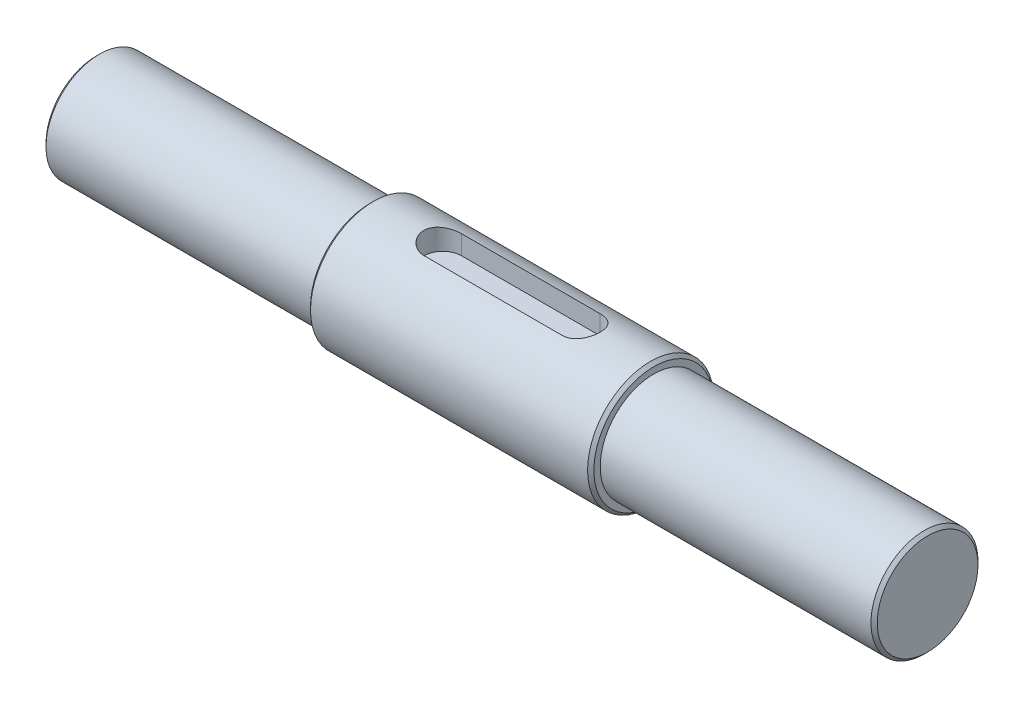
ISO-10303-21;
HEADER;
FILE_DESCRIPTION(('STEP AP214'),'2;1');
FILE_NAME('part.step','',(''),(''),'','','');
FILE_SCHEMA(('AUTOMOTIVE_DESIGN { 1 0 10303 214 1 1 1 1 }'));
ENDSEC;
DATA;
#1=APPLICATION_CONTEXT('core data for automotive mechanical design processes');
#2=APPLICATION_PROTOCOL_DEFINITION('international standard','automotive_design',2000,#1);
#3=PRODUCT_CONTEXT('',#1,'mechanical');
#4=PRODUCT('Part','Part','',(#3));
#5=PRODUCT_RELATED_PRODUCT_CATEGORY('part','',(#4));
#6=PRODUCT_DEFINITION_FORMATION('','',#4);
#7=PRODUCT_DEFINITION_CONTEXT('part definition',#1,'design');
#8=PRODUCT_DEFINITION('design','',#6,#7);
#9=PRODUCT_DEFINITION_SHAPE('','',#8);
#10=(LENGTH_UNIT() NAMED_UNIT(*) SI_UNIT(.MILLI.,.METRE.));
#11=(NAMED_UNIT(*) PLANE_ANGLE_UNIT() SI_UNIT($,.RADIAN.));
#12=(NAMED_UNIT(*) SI_UNIT($,.STERADIAN.) SOLID_ANGLE_UNIT());
#13=UNCERTAINTY_MEASURE_WITH_UNIT(LENGTH_MEASURE(1.E-05),#10,'distance_accuracy_value','');
#14=(GEOMETRIC_REPRESENTATION_CONTEXT(3) GLOBAL_UNCERTAINTY_ASSIGNED_CONTEXT((#13)) GLOBAL_UNIT_ASSIGNED_CONTEXT((#10,
#11,#12)) REPRESENTATION_CONTEXT('',''));
#15=CARTESIAN_POINT('',(0.,0.,0.));
#16=DIRECTION('',(0.,0.,1.));
#17=DIRECTION('',(1.,0.,0.));
#18=AXIS2_PLACEMENT_3D('',#15,#16,#17);
#19=CARTESIAN_POINT('',(88.5,0.,0.));
#20=DIRECTION('',(-1.,0.,0.));
#21=DIRECTION('',(0.,0.,1.));
#22=AXIS2_PLACEMENT_3D('',#19,#20,#21);
#23=CYLINDRICAL_SURFACE('',#22,10.);
#24=CARTESIAN_POINT('',(77.,9.53939201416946,3.));
#25=CARTESIAN_POINT('',(77.0823355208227,9.53938054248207,3.00001027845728));
#26=CARTESIAN_POINT('',(77.1646644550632,9.54045772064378,2.99661062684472));
#27=CARTESIAN_POINT('',(77.3286939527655,9.54470412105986,2.98307142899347));
#28=CARTESIAN_POINT('',(77.4103946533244,9.54787287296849,2.97293339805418));
#29=CARTESIAN_POINT('',(77.5723849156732,9.55620668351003,2.94603140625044));
#30=CARTESIAN_POINT('',(77.652677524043,9.56136667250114,2.92928426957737));
#31=CARTESIAN_POINT('',(77.8114758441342,9.57351626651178,2.88932853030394));
#32=CARTESIAN_POINT('',(77.8899815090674,9.58050591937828,2.8661197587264));
#33=CARTESIAN_POINT('',(78.1219493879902,9.60391637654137,2.78708584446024));
#34=CARTESIAN_POINT('',(78.272068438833,9.62279007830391,2.72181852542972));
#35=CARTESIAN_POINT('',(78.559226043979,9.66493213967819,2.56815043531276));
#36=CARTESIAN_POINT('',(78.6962584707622,9.68820254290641,2.4797388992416));
#37=CARTESIAN_POINT('',(78.9577229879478,9.73733650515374,2.27929879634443));
#38=CARTESIAN_POINT('',(79.0816848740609,9.76325505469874,2.16666914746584));
#39=CARTESIAN_POINT('',(79.3092736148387,9.81429628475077,1.92227736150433));
#40=CARTESIAN_POINT('',(79.412897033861,9.8394188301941,1.79051199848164));
#41=CARTESIAN_POINT('',(79.5989268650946,9.88666477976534,1.50821997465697));
#42=CARTESIAN_POINT('',(79.6808501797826,9.90871541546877,1.35736167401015));
#43=CARTESIAN_POINT('',(79.8179770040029,9.94668940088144,1.04324233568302));
#44=CARTESIAN_POINT('',(79.873187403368,9.96261433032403,0.879984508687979));
#45=CARTESIAN_POINT('',(79.953759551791,9.98615279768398,0.550649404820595));
#46=CARTESIAN_POINT('',(79.9799297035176,9.99399098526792,0.384786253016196));
#47=CARTESIAN_POINT('',(80.004234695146,10.0012640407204,0.0508471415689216));
#48=CARTESIAN_POINT('',(80.0023748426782,10.0007004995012,-0.117228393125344));
#49=CARTESIAN_POINT('',(79.9712141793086,9.99139205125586,-0.445143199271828));
#50=CARTESIAN_POINT('',(79.9427893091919,9.98290831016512,-0.605074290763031));
#51=CARTESIAN_POINT('',(79.8607367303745,9.95903027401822,-0.917780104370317));
#52=CARTESIAN_POINT('',(79.8071077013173,9.94363561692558,-1.07055445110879));
#53=CARTESIAN_POINT('',(79.6755755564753,9.90730429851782,-1.36669563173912));
#54=CARTESIAN_POINT('',(79.5973967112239,9.88630511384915,-1.50993201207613));
#55=CARTESIAN_POINT('',(79.4192028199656,9.84099249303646,-1.78153105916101));
#56=CARTESIAN_POINT('',(79.3191828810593,9.81667831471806,-1.90989038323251));
#57=CARTESIAN_POINT('',(79.0956160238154,9.7662334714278,-2.15330901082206));
#58=CARTESIAN_POINT('',(78.9713122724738,9.74006890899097,-2.26766702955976));
#59=CARTESIAN_POINT('',(78.7050051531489,9.68968430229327,-2.47413538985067));
#60=CARTESIAN_POINT('',(78.5629966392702,9.66546482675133,-2.5662392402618));
#61=CARTESIAN_POINT('',(78.2634381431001,9.62154457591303,-2.72632814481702));
#62=CARTESIAN_POINT('',(78.1057456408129,9.60189192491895,-2.79406012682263));
#63=CARTESIAN_POINT('',(77.7805509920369,9.56991327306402,-2.90171772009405));
#64=CARTESIAN_POINT('',(77.6130642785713,9.55757606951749,-2.94168586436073));
#65=CARTESIAN_POINT('',(77.3700102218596,9.54628064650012,-2.97802407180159));
#66=CARTESIAN_POINT('',(77.2962185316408,9.54370312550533,-2.98626405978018));
#67=CARTESIAN_POINT('',(77.148297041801,9.54025857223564,-2.99724711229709));
#68=CARTESIAN_POINT('',(77.0741679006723,9.53938902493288,-2.99999825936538));
#69=CARTESIAN_POINT('',(77.,9.53939201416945,-3.));
#70=B_SPLINE_CURVE_WITH_KNOTS('',3,(#24,#25,#26,#27,#28,#29,#30,#31,#32,#33,#34,#35,#36,#37,#38,
#39,#40,#41,#42,#43,#44,#45,#46,#47,#48,#49,#50,#51,#52,#53,#54,#55,#56,#57,#58,#59,#60,#61,#62,
#63,#64,#65,#66,#67,#68,#69),.UNSPECIFIED.,.F.,.F.,(4,2,2,2,2,2,2,2,2,2,2,2,2,2,2,2,2,2,2,2,2,2,
4),(0.,0.246918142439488,0.493780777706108,0.740019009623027,0.986263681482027,1.47813347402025,
1.97023245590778,2.47635119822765,2.98255536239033,3.4992281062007,4.01576751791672,
4.51753600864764,5.01920948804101,5.50490358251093,5.99062312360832,6.48200583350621,
6.9734987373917,7.48389234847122,7.99443465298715,8.51013494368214,9.02504345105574,
9.24774267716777,9.47011372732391),.UNSPECIFIED.);
#71=CARTESIAN_POINT('',(77.,9.53939201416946,3.));
#72=VERTEX_POINT('',#71);
#73=CARTESIAN_POINT('',(77.,9.53939201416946,-3.));
#74=VERTEX_POINT('',#73);
#75=EDGE_CURVE('E11',#72,#74,#70,.T.);
#76=ORIENTED_EDGE('',*,*,#75,.F.);
#77=DIRECTION('',(-1.,0.,0.));
#78=VECTOR('',#77,1.);
#79=CARTESIAN_POINT('',(88.5,9.53939201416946,3.));
#80=LINE('',#79,#78);
#81=CARTESIAN_POINT('',(55.,9.53939201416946,3.));
#82=VERTEX_POINT('',#81);
#83=EDGE_CURVE('E90',#82,#72,#80,.F.);
#84=ORIENTED_EDGE('',*,*,#83,.F.);
#85=CARTESIAN_POINT('',(55.,9.53939201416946,-3.));
#86=CARTESIAN_POINT('',(54.9176644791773,9.53938054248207,-3.00001027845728));
#87=CARTESIAN_POINT('',(54.8353355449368,9.54045772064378,-2.99661062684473));
#88=CARTESIAN_POINT('',(54.6713060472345,9.54470412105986,-2.98307142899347));
#89=CARTESIAN_POINT('',(54.5896053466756,9.54787287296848,-2.97293339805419));
#90=CARTESIAN_POINT('',(54.4276150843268,9.55620668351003,-2.94603140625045));
#91=CARTESIAN_POINT('',(54.347322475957,9.56136667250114,-2.92928426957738));
#92=CARTESIAN_POINT('',(54.1885241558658,9.57351626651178,-2.88932853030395));
#93=CARTESIAN_POINT('',(54.1100184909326,9.58050591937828,-2.86611975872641));
#94=CARTESIAN_POINT('',(53.8780506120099,9.60391637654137,-2.78708584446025));
#95=CARTESIAN_POINT('',(53.727931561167,9.62279007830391,-2.72181852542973));
#96=CARTESIAN_POINT('',(53.440773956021,9.66493213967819,-2.56815043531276));
#97=CARTESIAN_POINT('',(53.3037415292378,9.68820254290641,-2.4797388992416));
#98=CARTESIAN_POINT('',(53.0422770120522,9.73733650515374,-2.27929879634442));
#99=CARTESIAN_POINT('',(52.9183151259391,9.76325505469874,-2.16666914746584));
#100=CARTESIAN_POINT('',(52.6907263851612,9.81429628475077,-1.92227736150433));
#101=CARTESIAN_POINT('',(52.587102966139,9.8394188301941,-1.79051199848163));
#102=CARTESIAN_POINT('',(52.4010731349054,9.88666477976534,-1.50821997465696));
#103=CARTESIAN_POINT('',(52.3191498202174,9.90871541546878,-1.35736167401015));
#104=CARTESIAN_POINT('',(52.1820229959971,9.94668940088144,-1.04324233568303));
#105=CARTESIAN_POINT('',(52.126812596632,9.96261433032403,-0.879984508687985));
#106=CARTESIAN_POINT('',(52.046240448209,9.98615279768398,-0.550649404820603));
#107=CARTESIAN_POINT('',(52.0200702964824,9.99399098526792,-0.384786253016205));
#108=CARTESIAN_POINT('',(51.995765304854,10.0012640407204,-0.0508471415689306));
#109=CARTESIAN_POINT('',(51.9976251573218,10.0007004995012,0.117228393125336));
#110=CARTESIAN_POINT('',(52.0287858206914,9.99139205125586,0.445143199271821));
#111=CARTESIAN_POINT('',(52.0572106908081,9.98290831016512,0.605074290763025));
#112=CARTESIAN_POINT('',(52.1392632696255,9.95903027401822,0.917780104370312));
#113=CARTESIAN_POINT('',(52.1928922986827,9.94363561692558,1.07055445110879));
#114=CARTESIAN_POINT('',(52.3244244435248,9.90730429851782,1.36669563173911));
#115=CARTESIAN_POINT('',(52.4026032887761,9.88630511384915,1.50993201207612));
#116=CARTESIAN_POINT('',(52.5807971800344,9.84099249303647,1.781531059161));
#117=CARTESIAN_POINT('',(52.6808171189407,9.81667831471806,1.9098903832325));
#118=CARTESIAN_POINT('',(52.9043839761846,9.7662334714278,2.15330901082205));
#119=CARTESIAN_POINT('',(53.0286877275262,9.74006890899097,2.26766702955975));
#120=CARTESIAN_POINT('',(53.2949948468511,9.68968430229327,2.47413538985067));
#121=CARTESIAN_POINT('',(53.4370033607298,9.66546482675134,2.5662392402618));
#122=CARTESIAN_POINT('',(53.7365618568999,9.62154457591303,2.72632814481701));
#123=CARTESIAN_POINT('',(53.8942543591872,9.60189192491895,2.79406012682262));
#124=CARTESIAN_POINT('',(54.2194490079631,9.56991327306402,2.90171772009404));
#125=CARTESIAN_POINT('',(54.3869357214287,9.55757606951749,2.94168586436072));
#126=CARTESIAN_POINT('',(54.6299897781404,9.54628064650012,2.97802407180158));
#127=CARTESIAN_POINT('',(54.7037814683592,9.54370312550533,2.98626405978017));
#128=CARTESIAN_POINT('',(54.851702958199,9.54025857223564,2.99724711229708));
#129=CARTESIAN_POINT('',(54.9258320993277,9.53938902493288,2.99999825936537));
#130=CARTESIAN_POINT('',(55.,9.53939201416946,3.));
#131=B_SPLINE_CURVE_WITH_KNOTS('',3,(#85,#86,#87,#88,#89,#90,#91,#92,#93,#94,#95,#96,#97,#98,
#99,#100,#101,#102,#103,#104,#105,#106,#107,#108,#109,#110,#111,#112,#113,#114,#115,#116,#117,
#118,#119,#120,#121,#122,#123,#124,#125,#126,#127,#128,#129,#130),.UNSPECIFIED.,.F.,.F.,(4,2,2,
2,2,2,2,2,2,2,2,2,2,2,2,2,2,2,2,2,2,2,4),(0.,0.246918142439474,0.493780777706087,
0.740019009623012,0.986263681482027,1.47813347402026,1.97023245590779,2.47635119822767,
2.98255536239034,3.49922810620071,4.01576751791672,4.51753600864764,5.01920948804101,
5.50490358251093,5.99062312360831,6.48200583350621,6.9734987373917,7.48389234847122,
7.99443465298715,8.51013494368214,9.02504345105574,9.24774267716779,9.47011372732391),.UNSPECIFIED.);
#132=CARTESIAN_POINT('',(55.,9.53939201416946,-3.));
#133=VERTEX_POINT('',#132);
#134=EDGE_CURVE('E164',#133,#82,#131,.T.);
#135=ORIENTED_EDGE('',*,*,#134,.F.);
#136=DIRECTION('',(-1.,0.,0.));
#137=VECTOR('',#136,1.);
#138=CARTESIAN_POINT('',(88.5,9.53939201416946,-3.));
#139=LINE('',#138,#137);
#140=EDGE_CURVE('E56',#74,#133,#139,.T.);
#141=ORIENTED_EDGE('',*,*,#140,.F.);
#142=EDGE_LOOP('',(#76,#84,#135,#141));
#143=FACE_BOUND('',#142,.T.);
#144=CARTESIAN_POINT('',(88.,0.,0.));
#145=DIRECTION('',(1.,0.,0.));
#146=DIRECTION('',(0.,0.,-1.));
#147=AXIS2_PLACEMENT_3D('',#144,#145,#146);
#148=CIRCLE('',#147,10.);
#149=CARTESIAN_POINT('',(88.,0.,-10.));
#150=VERTEX_POINT('',#149);
#151=EDGE_CURVE('E134',#150,#150,#148,.F.);
#152=ORIENTED_EDGE('',*,*,#151,.T.);
#153=EDGE_LOOP('',(#152));
#154=FACE_BOUND('',#153,.T.);
#155=CARTESIAN_POINT('',(44.,0.,0.));
#156=DIRECTION('',(-1.,0.,0.));
#157=DIRECTION('',(0.,0.,1.));
#158=AXIS2_PLACEMENT_3D('',#155,#156,#157);
#159=CIRCLE('',#158,10.);
#160=CARTESIAN_POINT('',(44.,0.,10.));
#161=VERTEX_POINT('',#160);
#162=EDGE_CURVE('E127',#161,#161,#159,.F.);
#163=ORIENTED_EDGE('',*,*,#162,.T.);
#164=EDGE_LOOP('',(#163));
#165=FACE_BOUND('',#164,.T.);
#166=ADVANCED_FACE('F41',(#143,#154,#165),#23,.T.);
#167=CARTESIAN_POINT('',(88.5,10.,0.));
#168=DIRECTION('',(1.,0.,0.));
#169=DIRECTION('',(0.,0.,-1.));
#170=AXIS2_PLACEMENT_3D('',#167,#168,#169);
#171=PLANE('',#170);
#172=CARTESIAN_POINT('',(88.5,0.,0.));
#173=DIRECTION('',(1.,0.,0.));
#174=DIRECTION('',(0.,0.,-1.));
#175=AXIS2_PLACEMENT_3D('',#172,#173,#174);
#176=CIRCLE('',#175,9.49999999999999);
#177=CARTESIAN_POINT('',(88.5,0.,-9.49999999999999));
#178=VERTEX_POINT('',#177);
#179=EDGE_CURVE('E138',#178,#178,#176,.T.);
#180=ORIENTED_EDGE('',*,*,#179,.T.);
#181=EDGE_LOOP('',(#180));
#182=FACE_BOUND('',#181,.T.);
#183=CARTESIAN_POINT('',(88.5,0.,0.));
#184=DIRECTION('',(1.,0.,0.));
#185=DIRECTION('',(0.,0.,-1.));
#186=AXIS2_PLACEMENT_3D('',#183,#184,#185);
#187=CIRCLE('',#186,8.5);
#188=CARTESIAN_POINT('',(88.5,0.,-8.5));
#189=VERTEX_POINT('',#188);
#190=EDGE_CURVE('E123',#189,#189,#187,.T.);
#191=ORIENTED_EDGE('',*,*,#190,.F.);
#192=EDGE_LOOP('',(#191));
#193=FACE_BOUND('',#192,.T.);
#194=ADVANCED_FACE('F205',(#182,#193),#171,.T.);
#195=CARTESIAN_POINT('',(43.5,0.,0.));
#196=DIRECTION('',(-1.,0.,0.));
#197=DIRECTION('',(0.,0.,1.));
#198=AXIS2_PLACEMENT_3D('',#195,#196,#197);
#199=PLANE('',#198);
#200=CARTESIAN_POINT('',(43.5,0.,0.));
#201=DIRECTION('',(-1.,0.,0.));
#202=DIRECTION('',(0.,0.,1.));
#203=AXIS2_PLACEMENT_3D('',#200,#201,#202);
#204=CIRCLE('',#203,9.49999999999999);
#205=CARTESIAN_POINT('',(43.5,0.,9.49999999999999));
#206=VERTEX_POINT('',#205);
#207=EDGE_CURVE('E142',#206,#206,#204,.T.);
#208=ORIENTED_EDGE('',*,*,#207,.T.);
#209=EDGE_LOOP('',(#208));
#210=FACE_BOUND('',#209,.T.);
#211=CARTESIAN_POINT('',(43.5,0.,0.));
#212=DIRECTION('',(-1.,0.,0.));
#213=DIRECTION('',(0.,0.,1.));
#214=AXIS2_PLACEMENT_3D('',#211,#212,#213);
#215=CIRCLE('',#214,8.5);
#216=CARTESIAN_POINT('',(43.5,0.,8.5));
#217=VERTEX_POINT('',#216);
#218=EDGE_CURVE('E117',#217,#217,#215,.T.);
#219=ORIENTED_EDGE('',*,*,#218,.F.);
#220=EDGE_LOOP('',(#219));
#221=FACE_BOUND('',#220,.T.);
#222=ADVANCED_FACE('F202',(#210,#221),#199,.T.);
#223=CARTESIAN_POINT('',(0.,0.,0.));
#224=DIRECTION('',(1.,0.,0.));
#225=DIRECTION('',(0.,0.,-1.));
#226=AXIS2_PLACEMENT_3D('',#223,#224,#225);
#227=CYLINDRICAL_SURFACE('',#226,8.5);
#228=CARTESIAN_POINT('',(0.499999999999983,0.,0.));
#229=DIRECTION('',(-1.,0.,0.));
#230=DIRECTION('',(0.,0.,1.));
#231=AXIS2_PLACEMENT_3D('',#228,#229,#230);
#232=CIRCLE('',#231,8.5);
#233=CARTESIAN_POINT('',(0.499999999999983,0.,8.5));
#234=VERTEX_POINT('',#233);
#235=EDGE_CURVE('E150',#234,#234,#232,.F.);
#236=ORIENTED_EDGE('',*,*,#235,.T.);
#237=EDGE_LOOP('',(#236));
#238=FACE_BOUND('',#237,.T.);
#239=ORIENTED_EDGE('',*,*,#218,.T.);
#240=EDGE_LOOP('',(#239));
#241=FACE_BOUND('',#240,.T.);
#242=ADVANCED_FACE('F198',(#238,#241),#227,.T.);
#243=CARTESIAN_POINT('',(0.,0.,0.));
#244=DIRECTION('',(-1.,0.,0.));
#245=DIRECTION('',(0.,0.,1.));
#246=AXIS2_PLACEMENT_3D('',#243,#244,#245);
#247=PLANE('',#246);
#248=CARTESIAN_POINT('',(0.,0.,0.));
#249=DIRECTION('',(-1.,0.,0.));
#250=DIRECTION('',(0.,0.,1.));
#251=AXIS2_PLACEMENT_3D('',#248,#249,#250);
#252=CIRCLE('',#251,8.00000000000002);
#253=CARTESIAN_POINT('',(0.,0.,8.00000000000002));
#254=VERTEX_POINT('',#253);
#255=EDGE_CURVE('E146',#254,#254,#252,.T.);
#256=ORIENTED_EDGE('',*,*,#255,.T.);
#257=EDGE_LOOP('',(#256));
#258=FACE_BOUND('',#257,.T.);
#259=ADVANCED_FACE('F194',(#258),#247,.T.);
#260=CARTESIAN_POINT('',(132.,0.,0.));
#261=DIRECTION('',(-1.,0.,0.));
#262=DIRECTION('',(0.,0.,1.));
#263=AXIS2_PLACEMENT_3D('',#260,#261,#262);
#264=CYLINDRICAL_SURFACE('',#263,8.5);
#265=CARTESIAN_POINT('',(131.5,0.,0.));
#266=DIRECTION('',(1.,0.,0.));
#267=DIRECTION('',(0.,0.,-1.));
#268=AXIS2_PLACEMENT_3D('',#265,#266,#267);
#269=CIRCLE('',#268,8.5);
#270=CARTESIAN_POINT('',(131.5,0.,-8.5));
#271=VERTEX_POINT('',#270);
#272=EDGE_CURVE('E158',#271,#271,#269,.F.);
#273=ORIENTED_EDGE('',*,*,#272,.T.);
#274=EDGE_LOOP('',(#273));
#275=FACE_BOUND('',#274,.T.);
#276=ORIENTED_EDGE('',*,*,#190,.T.);
#277=EDGE_LOOP('',(#276));
#278=FACE_BOUND('',#277,.T.);
#279=ADVANCED_FACE('F190',(#275,#278),#264,.T.);
#280=CARTESIAN_POINT('',(132.,0.,0.));
#281=DIRECTION('',(1.,0.,0.));
#282=DIRECTION('',(0.,0.,-1.));
#283=AXIS2_PLACEMENT_3D('',#280,#281,#282);
#284=PLANE('',#283);
#285=CARTESIAN_POINT('',(132.,0.,0.));
#286=DIRECTION('',(1.,0.,0.));
#287=DIRECTION('',(0.,0.,-1.));
#288=AXIS2_PLACEMENT_3D('',#285,#286,#287);
#289=CIRCLE('',#288,8.00000000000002);
#290=CARTESIAN_POINT('',(132.,0.,-8.00000000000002));
#291=VERTEX_POINT('',#290);
#292=EDGE_CURVE('E154',#291,#291,#289,.T.);
#293=ORIENTED_EDGE('',*,*,#292,.T.);
#294=EDGE_LOOP('',(#293));
#295=FACE_BOUND('',#294,.T.);
#296=ADVANCED_FACE('F186',(#295),#284,.T.);
#297=CARTESIAN_POINT('',(88.,0.,0.));
#298=DIRECTION('',(-1.,0.,0.));
#299=DIRECTION('',(0.,0.,1.));
#300=AXIS2_PLACEMENT_3D('',#297,#298,#299);
#301=CONICAL_SURFACE('',#300,10.,0.785398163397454);
#302=ORIENTED_EDGE('',*,*,#179,.F.);
#303=EDGE_LOOP('',(#302));
#304=FACE_BOUND('',#303,.T.);
#305=ORIENTED_EDGE('',*,*,#151,.F.);
#306=EDGE_LOOP('',(#305));
#307=FACE_BOUND('',#306,.T.);
#308=ADVANCED_FACE('F189',(#304,#307),#301,.T.);
#309=CARTESIAN_POINT('',(43.5,0.,0.));
#310=DIRECTION('',(1.,0.,0.));
#311=DIRECTION('',(0.,0.,-1.));
#312=AXIS2_PLACEMENT_3D('',#309,#310,#311);
#313=CONICAL_SURFACE('',#312,9.49999999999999,0.785398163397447);
#314=ORIENTED_EDGE('',*,*,#162,.F.);
#315=EDGE_LOOP('',(#314));
#316=FACE_BOUND('',#315,.T.);
#317=ORIENTED_EDGE('',*,*,#207,.F.);
#318=EDGE_LOOP('',(#317));
#319=FACE_BOUND('',#318,.T.);
#320=ADVANCED_FACE('F220',(#316,#319),#313,.T.);
#321=CARTESIAN_POINT('',(0.,0.,0.));
#322=DIRECTION('',(1.,0.,0.));
#323=DIRECTION('',(0.,0.,-1.));
#324=AXIS2_PLACEMENT_3D('',#321,#322,#323);
#325=CONICAL_SURFACE('',#324,8.00000000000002,0.785398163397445);
#326=ORIENTED_EDGE('',*,*,#235,.F.);
#327=EDGE_LOOP('',(#326));
#328=FACE_BOUND('',#327,.T.);
#329=ORIENTED_EDGE('',*,*,#255,.F.);
#330=EDGE_LOOP('',(#329));
#331=FACE_BOUND('',#330,.T.);
#332=ADVANCED_FACE('F228',(#328,#331),#325,.T.);
#333=CARTESIAN_POINT('',(132.,0.,0.));
#334=DIRECTION('',(-1.,0.,0.));
#335=DIRECTION('',(0.,0.,1.));
#336=AXIS2_PLACEMENT_3D('',#333,#334,#335);
#337=CONICAL_SURFACE('',#336,8.00000000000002,0.785398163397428);
#338=ORIENTED_EDGE('',*,*,#272,.F.);
#339=EDGE_LOOP('',(#338));
#340=FACE_BOUND('',#339,.T.);
#341=ORIENTED_EDGE('',*,*,#292,.F.);
#342=EDGE_LOOP('',(#341));
#343=FACE_BOUND('',#342,.T.);
#344=ADVANCED_FACE('F43',(#340,#343),#337,.T.);
#345=CARTESIAN_POINT('',(77.,16.5,0.));
#346=DIRECTION('',(0.,-1.,0.));
#347=DIRECTION('',(0.,0.,-1.));
#348=AXIS2_PLACEMENT_3D('',#345,#346,#347);
#349=CYLINDRICAL_SURFACE('',#348,3.);
#350=ORIENTED_EDGE('',*,*,#75,.T.);
#351=DIRECTION('',(0.,-1.,0.));
#352=VECTOR('',#351,1.);
#353=CARTESIAN_POINT('',(77.,16.5,-3.));
#354=LINE('',#353,#352);
#355=CARTESIAN_POINT('',(77.,6.50000000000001,-3.));
#356=VERTEX_POINT('',#355);
#357=EDGE_CURVE('E107',#74,#356,#354,.T.);
#358=ORIENTED_EDGE('',*,*,#357,.T.);
#359=CARTESIAN_POINT('',(77.,6.50000000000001,0.));
#360=DIRECTION('',(0.,-1.,0.));
#361=DIRECTION('',(0.,0.,-1.));
#362=AXIS2_PLACEMENT_3D('',#359,#360,#361);
#363=CIRCLE('',#362,3.);
#364=CARTESIAN_POINT('',(77.,6.50000000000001,3.));
#365=VERTEX_POINT('',#364);
#366=EDGE_CURVE('E100',#356,#365,#363,.T.);
#367=ORIENTED_EDGE('',*,*,#366,.T.);
#368=DIRECTION('',(0.,-1.,0.));
#369=VECTOR('',#368,1.);
#370=CARTESIAN_POINT('',(77.,16.5,3.));
#371=LINE('',#370,#369);
#372=EDGE_CURVE('E85',#72,#365,#371,.T.);
#373=ORIENTED_EDGE('',*,*,#372,.F.);
#374=EDGE_LOOP('',(#350,#358,#367,#373));
#375=FACE_BOUND('',#374,.T.);
#376=ADVANCED_FACE('F106',(#375),#349,.F.);
#377=CARTESIAN_POINT('',(55.,16.5,-3.));
#378=DIRECTION('',(0.,0.,-1.));
#379=DIRECTION('',(0.,1.,0.));
#380=AXIS2_PLACEMENT_3D('',#377,#378,#379);
#381=PLANE('',#380);
#382=ORIENTED_EDGE('',*,*,#140,.T.);
#383=DIRECTION('',(0.,-1.,0.));
#384=VECTOR('',#383,1.);
#385=CARTESIAN_POINT('',(55.,16.5,-3.));
#386=LINE('',#385,#384);
#387=CARTESIAN_POINT('',(55.,6.50000000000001,-3.));
#388=VERTEX_POINT('',#387);
#389=EDGE_CURVE('E118',#133,#388,#386,.T.);
#390=ORIENTED_EDGE('',*,*,#389,.T.);
#391=DIRECTION('',(1.,0.,0.));
#392=VECTOR('',#391,1.);
#393=CARTESIAN_POINT('',(55.,6.50000000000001,-3.));
#394=LINE('',#393,#392);
#395=EDGE_CURVE('E93',#388,#356,#394,.T.);
#396=ORIENTED_EDGE('',*,*,#395,.T.);
#397=ORIENTED_EDGE('',*,*,#357,.F.);
#398=EDGE_LOOP('',(#382,#390,#396,#397));
#399=FACE_BOUND('',#398,.T.);
#400=ADVANCED_FACE('F179',(#399),#381,.F.);
#401=CARTESIAN_POINT('',(55.,16.5,0.));
#402=DIRECTION('',(0.,-1.,0.));
#403=DIRECTION('',(0.,0.,-1.));
#404=AXIS2_PLACEMENT_3D('',#401,#402,#403);
#405=CYLINDRICAL_SURFACE('',#404,3.);
#406=ORIENTED_EDGE('',*,*,#134,.T.);
#407=DIRECTION('',(0.,-1.,0.));
#408=VECTOR('',#407,1.);
#409=CARTESIAN_POINT('',(55.,16.5,2.99999999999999));
#410=LINE('',#409,#408);
#411=CARTESIAN_POINT('',(55.,6.50000000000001,3.));
#412=VERTEX_POINT('',#411);
#413=EDGE_CURVE('E63',#82,#412,#410,.T.);
#414=ORIENTED_EDGE('',*,*,#413,.T.);
#415=CARTESIAN_POINT('',(55.,6.50000000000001,0.));
#416=DIRECTION('',(0.,-1.,0.));
#417=DIRECTION('',(0.,0.,-1.));
#418=AXIS2_PLACEMENT_3D('',#415,#416,#417);
#419=CIRCLE('',#418,3.);
#420=EDGE_CURVE('E103',#412,#388,#419,.T.);
#421=ORIENTED_EDGE('',*,*,#420,.T.);
#422=ORIENTED_EDGE('',*,*,#389,.F.);
#423=EDGE_LOOP('',(#406,#414,#421,#422));
#424=FACE_BOUND('',#423,.T.);
#425=ADVANCED_FACE('F174',(#424),#405,.F.);
#426=CARTESIAN_POINT('',(77.,16.5,3.));
#427=DIRECTION('',(0.,0.,1.));
#428=DIRECTION('',(0.,-1.,0.));
#429=AXIS2_PLACEMENT_3D('',#426,#427,#428);
#430=PLANE('',#429);
#431=ORIENTED_EDGE('',*,*,#83,.T.);
#432=ORIENTED_EDGE('',*,*,#372,.T.);
#433=DIRECTION('',(-1.,0.,0.));
#434=VECTOR('',#433,1.);
#435=CARTESIAN_POINT('',(77.,6.50000000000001,3.));
#436=LINE('',#435,#434);
#437=EDGE_CURVE('E88',#365,#412,#436,.T.);
#438=ORIENTED_EDGE('',*,*,#437,.T.);
#439=ORIENTED_EDGE('',*,*,#413,.F.);
#440=EDGE_LOOP('',(#431,#432,#438,#439));
#441=FACE_BOUND('',#440,.T.);
#442=ADVANCED_FACE('F87',(#441),#430,.F.);
#443=CARTESIAN_POINT('',(77.,6.50000000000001,0.));
#444=DIRECTION('',(0.,-1.,0.));
#445=DIRECTION('',(0.,0.,-1.));
#446=AXIS2_PLACEMENT_3D('',#443,#444,#445);
#447=PLANE('',#446);
#448=ORIENTED_EDGE('',*,*,#366,.F.);
#449=ORIENTED_EDGE('',*,*,#395,.F.);
#450=ORIENTED_EDGE('',*,*,#420,.F.);
#451=ORIENTED_EDGE('',*,*,#437,.F.);
#452=EDGE_LOOP('',(#448,#449,#450,#451));
#453=FACE_BOUND('',#452,.T.);
#454=ADVANCED_FACE('F98',(#453),#447,.F.);
#455=CLOSED_SHELL('',(#166,#194,#222,#242,#259,#279,#296,#308,#320,#332,#344,#376,#400,#425,
#442,#454));
#456=MANIFOLD_SOLID_BREP('B2',#455);
#457=ADVANCED_BREP_SHAPE_REPRESENTATION('',(#18,#456),#14);
#458=SHAPE_DEFINITION_REPRESENTATION(#9,#457);
ENDSEC;
END-ISO-10303-21;
